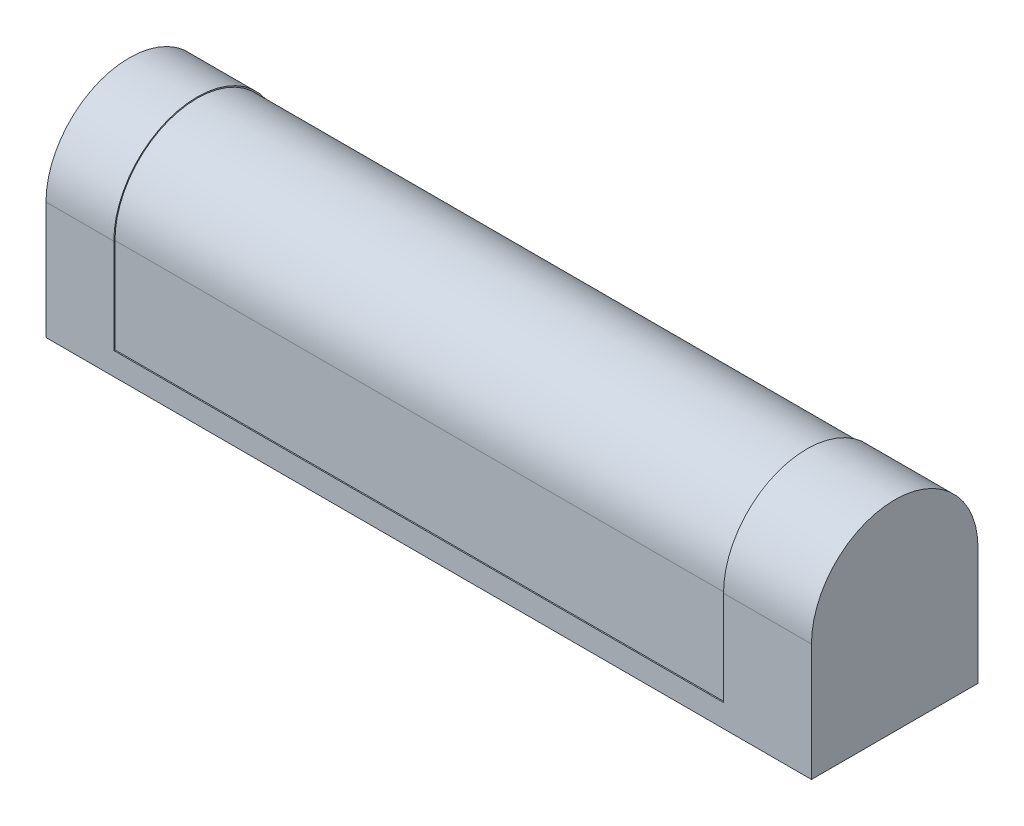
from build123d import *

# Parameters (mm, degrees)
BOSS_EXTRUDE1_DEPTH = 285
SKETCH2_W           = 71.432157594
SKETCH2_H           = 77.878153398
CUT_EXTRUDE1_DEPTH  = 227
SKETCH3_W           = 61.568158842
SKETCH3_H           = 5.383122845
BOSS_EXTRUDE2_DEPTH = 227
SKETCH4_W           = 227
SKETCH4_H           = 8.438834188
BOSS_EXTRUDE3_DEPTH = 0.431841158
SKETCH5_R           = 4
CUT_EXTRUDE2_DEPTH  = 10


with BuildPart() as part:
    # Sketch1 → Boss-Extrude1 (new body)
    with BuildSketch(Plane(origin=(0, 0, 0), x_dir=(0, 0, -1), z_dir=(1, 0, 0))):
        with BuildLine():
            Line((-31, 0), (-31, -43.7))
            Line((-31, -43.7), (31, -43.7))
            Line((31, -43.7), (31, 0))
            ThreePointArc((31, 0), (0, 31), (-31, 0))
        make_face()
    extrude(amount=BOSS_EXTRUDE1_DEPTH)

    # Sketch2 → Cut-Extrude1 (cut)
    with BuildSketch(Plane.ZY.offset(-25.25)):
        with Locations((-1.841713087, -7.402407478)):
            Rectangle(SKETCH2_W, SKETCH2_H)
        with BuildLine():
            Line((-30.568158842, 0), (-30.568158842, -38.316877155))
            Line((-30.568158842, -38.316877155), (30.568158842, -38.316877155))
            Line((30.568158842, -38.316877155), (30.568158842, 0))
            ThreePointArc((30.568158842, 0), (0, 30.568158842), (-30.568158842, 0))
        make_face(mode=Mode.SUBTRACT)
    extrude(amount=-CUT_EXTRUDE1_DEPTH, mode=Mode.SUBTRACT)

    # Sketch3 → Boss-Extrude2 (add)
    with BuildSketch(Plane(origin=(25.25, 0, 0), x_dir=(0, 0, -1), z_dir=(1, 0, 0))):
        with Locations((0.215920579, -41.008438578)):
            Rectangle(SKETCH3_W, SKETCH3_H)
    extrude(amount=BOSS_EXTRUDE2_DEPTH)

    # Sketch4 → Boss-Extrude3 (add)
    with BuildSketch(Plane.XY.offset(30.568158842)):
        with Locations((138.75, -39.480582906)):
            Rectangle(SKETCH4_W, SKETCH4_H)
    extrude(amount=BOSS_EXTRUDE3_DEPTH)

    # Sketch5 → Cut-Extrude2 (cut)
    with BuildSketch(Plane.XZ.offset(43.7)):
        with Locations(Location((5.975, 25.4, 0), (0, 0, 270))):
            Circle(SKETCH5_R)
        with Locations(Location((5.975, -25.4, 0), (0, 0, 270))):
            Circle(SKETCH5_R)
        with Locations(Location((279.025, 25.4, 0), (0, 0, 270))):
            Circle(SKETCH5_R)
        with Locations(Location((279.025, -25.4, 0), (0, 0, 270))):
            Circle(SKETCH5_R)
    extrude(amount=-CUT_EXTRUDE2_DEPTH, mode=Mode.SUBTRACT)


solid = part.part
